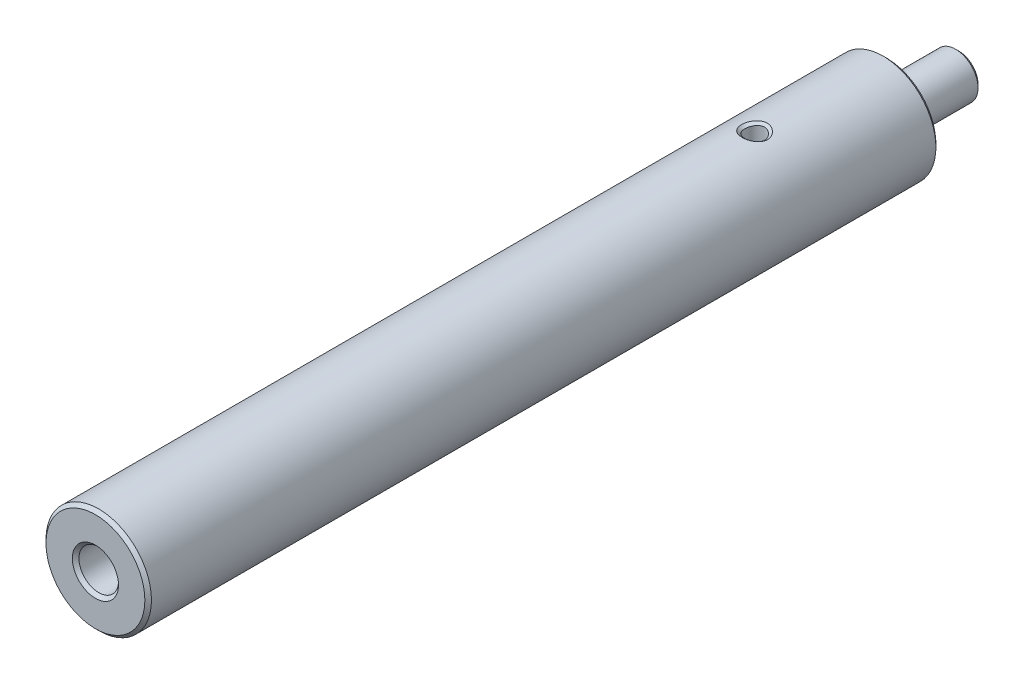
ISO-10303-21;
HEADER;
FILE_DESCRIPTION(('STEP AP214'),'2;1');
FILE_NAME('part.step','',(''),(''),'','','');
FILE_SCHEMA(('AUTOMOTIVE_DESIGN { 1 0 10303 214 1 1 1 1 }'));
ENDSEC;
DATA;
#1=APPLICATION_CONTEXT('core data for automotive mechanical design processes');
#2=APPLICATION_PROTOCOL_DEFINITION('international standard','automotive_design',2000,#1);
#3=PRODUCT_CONTEXT('',#1,'mechanical');
#4=PRODUCT('Part','Part','',(#3));
#5=PRODUCT_RELATED_PRODUCT_CATEGORY('part','',(#4));
#6=PRODUCT_DEFINITION_FORMATION('','',#4);
#7=PRODUCT_DEFINITION_CONTEXT('part definition',#1,'design');
#8=PRODUCT_DEFINITION('design','',#6,#7);
#9=PRODUCT_DEFINITION_SHAPE('','',#8);
#10=(LENGTH_UNIT() NAMED_UNIT(*) SI_UNIT(.MILLI.,.METRE.));
#11=(NAMED_UNIT(*) PLANE_ANGLE_UNIT() SI_UNIT($,.RADIAN.));
#12=(NAMED_UNIT(*) SI_UNIT($,.STERADIAN.) SOLID_ANGLE_UNIT());
#13=UNCERTAINTY_MEASURE_WITH_UNIT(LENGTH_MEASURE(1.E-05),#10,'distance_accuracy_value','');
#14=(GEOMETRIC_REPRESENTATION_CONTEXT(3) GLOBAL_UNCERTAINTY_ASSIGNED_CONTEXT((#13)) GLOBAL_UNIT_ASSIGNED_CONTEXT((#10,
#11,#12)) REPRESENTATION_CONTEXT('',''));
#15=CARTESIAN_POINT('',(0.,0.,0.));
#16=DIRECTION('',(0.,0.,1.));
#17=DIRECTION('',(1.,0.,0.));
#18=AXIS2_PLACEMENT_3D('',#15,#16,#17);
#19=CARTESIAN_POINT('',(0.,0.,0.));
#20=DIRECTION('',(0.,0.,1.));
#21=DIRECTION('',(1.,0.,0.));
#22=AXIS2_PLACEMENT_3D('',#19,#20,#21);
#23=PLANE('',#22);
#24=CARTESIAN_POINT('',(0.,0.,0.));
#25=DIRECTION('',(0.,0.,1.));
#26=DIRECTION('',(1.,0.,0.));
#27=AXIS2_PLACEMENT_3D('',#24,#25,#26);
#28=CIRCLE('',#27,1.24999999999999);
#29=CARTESIAN_POINT('',(1.24999999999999,0.,0.));
#30=VERTEX_POINT('',#29);
#31=EDGE_CURVE('E44',#30,#30,#28,.T.);
#32=ORIENTED_EDGE('',*,*,#31,.T.);
#33=EDGE_LOOP('',(#32));
#34=FACE_BOUND('',#33,.T.);
#35=ADVANCED_FACE('F29',(#34),#23,.T.);
#36=CARTESIAN_POINT('',(0.,0.,-50.5));
#37=DIRECTION('',(0.,0.,-1.));
#38=DIRECTION('',(-1.,0.,0.));
#39=AXIS2_PLACEMENT_3D('',#36,#37,#38);
#40=CYLINDRICAL_SURFACE('',#39,1.49999999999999);
#41=CARTESIAN_POINT('',(0.,0.,14.75));
#42=DIRECTION('',(0.,0.,1.));
#43=DIRECTION('',(1.,0.,0.));
#44=AXIS2_PLACEMENT_3D('',#41,#42,#43);
#45=CIRCLE('',#44,1.49999999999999);
#46=CARTESIAN_POINT('',(1.49999999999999,0.,14.75));
#47=VERTEX_POINT('',#46);
#48=EDGE_CURVE('E193',#47,#47,#45,.T.);
#49=ORIENTED_EDGE('',*,*,#48,.T.);
#50=EDGE_LOOP('',(#49));
#51=FACE_BOUND('',#50,.T.);
#52=CARTESIAN_POINT('',(0.,0.,0.25));
#53=DIRECTION('',(0.,0.,1.));
#54=DIRECTION('',(1.,0.,0.));
#55=AXIS2_PLACEMENT_3D('',#52,#53,#54);
#56=CIRCLE('',#55,1.49999999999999);
#57=CARTESIAN_POINT('',(1.49999999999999,0.,0.25));
#58=VERTEX_POINT('',#57);
#59=EDGE_CURVE('E185',#58,#58,#56,.F.);
#60=ORIENTED_EDGE('',*,*,#59,.T.);
#61=EDGE_LOOP('',(#60));
#62=FACE_BOUND('',#61,.T.);
#63=ADVANCED_FACE('F205',(#51,#62),#40,.F.);
#64=CARTESIAN_POINT('',(0.,1.49999999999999,15.));
#65=DIRECTION('',(0.,0.,1.));
#66=DIRECTION('',(1.,0.,0.));
#67=AXIS2_PLACEMENT_3D('',#64,#65,#66);
#68=PLANE('',#67);
#69=CARTESIAN_POINT('',(0.,0.,15.));
#70=DIRECTION('',(0.,0.,1.));
#71=DIRECTION('',(1.,0.,0.));
#72=AXIS2_PLACEMENT_3D('',#69,#70,#71);
#73=CIRCLE('',#72,3.75);
#74=CARTESIAN_POINT('',(3.75,0.,15.));
#75=VERTEX_POINT('',#74);
#76=EDGE_CURVE('E159',#75,#75,#73,.T.);
#77=ORIENTED_EDGE('',*,*,#76,.T.);
#78=EDGE_LOOP('',(#77));
#79=FACE_BOUND('',#78,.T.);
#80=CARTESIAN_POINT('',(0.,0.,15.));
#81=DIRECTION('',(0.,0.,1.));
#82=DIRECTION('',(1.,0.,0.));
#83=AXIS2_PLACEMENT_3D('',#80,#81,#82);
#84=CIRCLE('',#83,1.74999999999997);
#85=CARTESIAN_POINT('',(1.74999999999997,0.,15.));
#86=VERTEX_POINT('',#85);
#87=EDGE_CURVE('E156',#86,#86,#84,.F.);
#88=ORIENTED_EDGE('',*,*,#87,.T.);
#89=EDGE_LOOP('',(#88));
#90=FACE_BOUND('',#89,.T.);
#91=ADVANCED_FACE('F138',(#79,#90),#68,.T.);
#92=CARTESIAN_POINT('',(0.,0.,-50.5));
#93=DIRECTION('',(0.,0.,-1.));
#94=DIRECTION('',(-1.,0.,0.));
#95=AXIS2_PLACEMENT_3D('',#92,#93,#94);
#96=CYLINDRICAL_SURFACE('',#95,3.99999999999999);
#97=CARTESIAN_POINT('',(0.,0.,-44.75));
#98=DIRECTION('',(0.,0.,-1.));
#99=DIRECTION('',(-1.,0.,0.));
#100=AXIS2_PLACEMENT_3D('',#97,#98,#99);
#101=CIRCLE('',#100,3.99999999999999);
#102=CARTESIAN_POINT('',(-3.99999999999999,0.,-44.75));
#103=VERTEX_POINT('',#102);
#104=EDGE_CURVE('E153',#103,#103,#101,.F.);
#105=ORIENTED_EDGE('',*,*,#104,.T.);
#106=EDGE_LOOP('',(#105));
#107=FACE_BOUND('',#106,.T.);
#108=CARTESIAN_POINT('',(0.,0.,14.75));
#109=DIRECTION('',(0.,0.,1.));
#110=DIRECTION('',(1.,0.,0.));
#111=AXIS2_PLACEMENT_3D('',#108,#109,#110);
#112=CIRCLE('',#111,3.99999999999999);
#113=CARTESIAN_POINT('',(3.99999999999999,0.,14.75));
#114=VERTEX_POINT('',#113);
#115=EDGE_CURVE('E113',#114,#114,#112,.F.);
#116=ORIENTED_EDGE('',*,*,#115,.T.);
#117=EDGE_LOOP('',(#116));
#118=FACE_BOUND('',#117,.T.);
#119=CARTESIAN_POINT('',(0.,3.99999999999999,-34.0540393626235));
#120=CARTESIAN_POINT('',(0.529767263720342,4.00000418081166,-34.0540683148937));
#121=CARTESIAN_POINT('',(0.986968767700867,3.87636399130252,-34.4920224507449));
#122=CARTESIAN_POINT('',(0.986931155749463,3.87629484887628,-35.5074001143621));
#123=CARTESIAN_POINT('',(0.53069592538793,3.9999960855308,-35.9459678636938));
#124=CARTESIAN_POINT('',(-0.530811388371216,4.00000391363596,-35.9459534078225));
#125=CARTESIAN_POINT('',(-0.986852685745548,3.87629943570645,-35.5070128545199));
#126=CARTESIAN_POINT('',(-0.987046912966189,3.87635948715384,-34.4917578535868));
#127=CARTESIAN_POINT('',(-0.529767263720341,3.99999581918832,-34.0540104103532));
#128=CARTESIAN_POINT('',(0.,3.99999999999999,-34.0540393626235));
#129=B_SPLINE_CURVE_WITH_KNOTS('',3,(#119,#120,#121,#122,#123,#124,#125,#126,#127,#128),
.UNSPECIFIED.,.T.,.F.,(4,2,2,2,4),(-0.00592829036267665,-0.00444372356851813,
-0.00295915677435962,-0.00147458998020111,9.97681395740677E-06),.UNSPECIFIED.);
#130=CARTESIAN_POINT('',(0.,3.99999999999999,-34.0540393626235));
#131=VERTEX_POINT('',#130);
#132=EDGE_CURVE('E110',#131,#131,#129,.F.);
#133=ORIENTED_EDGE('',*,*,#132,.T.);
#134=EDGE_LOOP('',(#133));
#135=FACE_BOUND('',#134,.T.);
#136=CARTESIAN_POINT('',(0.,-3.99999999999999,-34.0540393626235));
#137=CARTESIAN_POINT('',(-0.529767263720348,-4.00000418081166,-34.0540683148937));
#138=CARTESIAN_POINT('',(-0.986968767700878,-3.87636399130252,-34.4920224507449));
#139=CARTESIAN_POINT('',(-0.986931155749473,-3.87629484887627,-35.5074001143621));
#140=CARTESIAN_POINT('',(-0.530695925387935,-3.9999960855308,-35.9459678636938));
#141=CARTESIAN_POINT('',(0.530811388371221,-4.00000391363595,-35.9459534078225));
#142=CARTESIAN_POINT('',(0.986852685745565,-3.87629943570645,-35.5070128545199));
#143=CARTESIAN_POINT('',(0.987046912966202,-3.87635948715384,-34.4917578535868));
#144=CARTESIAN_POINT('',(0.529767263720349,-3.99999581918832,-34.0540104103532));
#145=CARTESIAN_POINT('',(0.,-3.99999999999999,-34.0540393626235));
#146=B_SPLINE_CURVE_WITH_KNOTS('',3,(#136,#137,#138,#139,#140,#141,#142,#143,#144,#145),
.UNSPECIFIED.,.T.,.F.,(4,2,2,2,4),(-0.00592829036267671,-0.00444372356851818,
-0.00295915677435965,-0.00147458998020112,9.9768139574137E-06),.UNSPECIFIED.);
#147=CARTESIAN_POINT('',(0.,-3.99999999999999,-34.0540393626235));
#148=VERTEX_POINT('',#147);
#149=EDGE_CURVE('E107',#148,#148,#146,.F.);
#150=ORIENTED_EDGE('',*,*,#149,.T.);
#151=EDGE_LOOP('',(#150));
#152=FACE_BOUND('',#151,.T.);
#153=ADVANCED_FACE('F127',(#107,#118,#135,#152),#96,.T.);
#154=CARTESIAN_POINT('',(0.,3.99999999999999,-45.));
#155=DIRECTION('',(0.,0.,-1.));
#156=DIRECTION('',(-1.,0.,0.));
#157=AXIS2_PLACEMENT_3D('',#154,#155,#156);
#158=PLANE('',#157);
#159=CARTESIAN_POINT('',(0.,0.,-45.));
#160=DIRECTION('',(0.,0.,-1.));
#161=DIRECTION('',(-1.,0.,0.));
#162=AXIS2_PLACEMENT_3D('',#159,#160,#161);
#163=CIRCLE('',#162,3.75);
#164=CARTESIAN_POINT('',(-3.75,0.,-45.));
#165=VERTEX_POINT('',#164);
#166=EDGE_CURVE('E111',#165,#165,#163,.T.);
#167=ORIENTED_EDGE('',*,*,#166,.T.);
#168=EDGE_LOOP('',(#167));
#169=FACE_BOUND('',#168,.T.);
#170=CARTESIAN_POINT('',(0.,0.,-45.));
#171=DIRECTION('',(0.,0.,-1.));
#172=DIRECTION('',(-1.,0.,0.));
#173=AXIS2_PLACEMENT_3D('',#170,#171,#172);
#174=CIRCLE('',#173,1.7);
#175=CARTESIAN_POINT('',(-1.7,0.,-45.));
#176=VERTEX_POINT('',#175);
#177=EDGE_CURVE('E115',#176,#176,#174,.T.);
#178=ORIENTED_EDGE('',*,*,#177,.F.);
#179=EDGE_LOOP('',(#178));
#180=FACE_BOUND('',#179,.T.);
#181=ADVANCED_FACE('F137',(#169,#180),#158,.T.);
#182=CARTESIAN_POINT('',(0.,0.,-50.5));
#183=DIRECTION('',(0.,0.,-1.));
#184=DIRECTION('',(-1.,0.,0.));
#185=AXIS2_PLACEMENT_3D('',#182,#183,#184);
#186=CYLINDRICAL_SURFACE('',#185,1.7);
#187=CARTESIAN_POINT('',(0.,0.,-50.25));
#188=DIRECTION('',(0.,0.,-1.));
#189=DIRECTION('',(-1.,0.,0.));
#190=AXIS2_PLACEMENT_3D('',#187,#188,#189);
#191=CIRCLE('',#190,1.7);
#192=CARTESIAN_POINT('',(-1.7,0.,-50.25));
#193=VERTEX_POINT('',#192);
#194=EDGE_CURVE('E10',#193,#193,#191,.F.);
#195=ORIENTED_EDGE('',*,*,#194,.T.);
#196=EDGE_LOOP('',(#195));
#197=FACE_BOUND('',#196,.T.);
#198=ORIENTED_EDGE('',*,*,#177,.T.);
#199=EDGE_LOOP('',(#198));
#200=FACE_BOUND('',#199,.T.);
#201=ADVANCED_FACE('F267',(#197,#200),#186,.T.);
#202=CARTESIAN_POINT('',(0.,1.7,-50.5));
#203=DIRECTION('',(0.,0.,-1.));
#204=DIRECTION('',(-1.,0.,0.));
#205=AXIS2_PLACEMENT_3D('',#202,#203,#204);
#206=PLANE('',#205);
#207=CARTESIAN_POINT('',(0.,0.,-50.5));
#208=DIRECTION('',(0.,0.,-1.));
#209=DIRECTION('',(-1.,0.,0.));
#210=AXIS2_PLACEMENT_3D('',#207,#208,#209);
#211=CIRCLE('',#210,1.45000000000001);
#212=CARTESIAN_POINT('',(-1.45000000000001,0.,-50.5));
#213=VERTEX_POINT('',#212);
#214=EDGE_CURVE('E39',#213,#213,#211,.T.);
#215=ORIENTED_EDGE('',*,*,#214,.T.);
#216=EDGE_LOOP('',(#215));
#217=FACE_BOUND('',#216,.T.);
#218=ADVANCED_FACE('F179',(#217),#206,.T.);
#219=CARTESIAN_POINT('',(0.,-5.,-35.));
#220=DIRECTION('',(0.,1.,0.));
#221=DIRECTION('',(0.,0.,1.));
#222=AXIS2_PLACEMENT_3D('',#219,#220,#221);
#223=CYLINDRICAL_SURFACE('',#222,0.750000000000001);
#224=CARTESIAN_POINT('',(0.,3.83387458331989,-34.25));
#225=CARTESIAN_POINT('',(-0.0125312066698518,3.83387479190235,-34.2499984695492));
#226=CARTESIAN_POINT('',(-0.0250619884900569,3.83375953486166,-34.2503348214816));
#227=CARTESIAN_POINT('',(-0.0499976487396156,3.8333105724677,-34.251672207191));
#228=CARTESIAN_POINT('',(-0.0624028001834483,3.83297837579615,-34.2526686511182));
#229=CARTESIAN_POINT('',(-0.087068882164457,3.83211006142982,-34.2553081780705));
#230=CARTESIAN_POINT('',(-0.0993302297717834,3.83157505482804,-34.2569477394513));
#231=CARTESIAN_POINT('',(-0.123690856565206,3.83031606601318,-34.260854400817));
#232=CARTESIAN_POINT('',(-0.135790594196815,3.82959286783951,-34.2631188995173));
#233=CARTESIAN_POINT('',(-0.159810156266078,3.82797223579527,-34.2682568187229));
#234=CARTESIAN_POINT('',(-0.171730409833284,3.8270753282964,-34.2711284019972));
#235=CARTESIAN_POINT('',(-0.195373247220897,3.82512198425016,-34.2774619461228));
#236=CARTESIAN_POINT('',(-0.207096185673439,3.82406587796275,-34.2809226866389));
#237=CARTESIAN_POINT('',(-0.230326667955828,3.82180877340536,-34.2884161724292));
#238=CARTESIAN_POINT('',(-0.241834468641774,3.82060796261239,-34.2924481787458));
#239=CARTESIAN_POINT('',(-0.264616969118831,3.81807603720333,-34.3010659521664));
#240=CARTESIAN_POINT('',(-0.275891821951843,3.81674501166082,-34.3056513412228));
#241=CARTESIAN_POINT('',(-0.29819072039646,3.81396720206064,-34.3153577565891));
#242=CARTESIAN_POINT('',(-0.309214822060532,3.81252044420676,-34.3204786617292));
#243=CARTESIAN_POINT('',(-0.330994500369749,3.80952568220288,-34.3312380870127));
#244=CARTESIAN_POINT('',(-0.341750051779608,3.80797766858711,-34.336876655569));
#245=CARTESIAN_POINT('',(-0.362974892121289,3.80479488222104,-34.3486534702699));
#246=CARTESIAN_POINT('',(-0.37344409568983,3.80316008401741,-34.3547918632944));
#247=CARTESIAN_POINT('',(-0.394078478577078,3.79981819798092,-34.3675504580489));
#248=CARTESIAN_POINT('',(-0.404243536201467,3.79811108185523,-34.3741708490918));
#249=CARTESIAN_POINT('',(-0.424251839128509,3.79463901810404,-34.3878756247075));
#250=CARTESIAN_POINT('',(-0.434094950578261,3.79287404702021,-34.3949601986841));
#251=CARTESIAN_POINT('',(-0.453441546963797,3.78930072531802,-34.4095755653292));
#252=CARTESIAN_POINT('',(-0.462944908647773,3.78749235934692,-34.41710651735));
#253=CARTESIAN_POINT('',(-0.481594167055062,3.78384669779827,-34.4325968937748));
#254=CARTESIAN_POINT('',(-0.490739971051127,3.7820093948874,-34.4405564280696));
#255=CARTESIAN_POINT('',(-0.508656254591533,3.77832031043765,-34.4568862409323));
#256=CARTESIAN_POINT('',(-0.517426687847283,3.77646852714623,-34.4652565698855));
#257=CARTESIAN_POINT('',(-0.534574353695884,3.77276493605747,-34.4823902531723));
#258=CARTESIAN_POINT('',(-0.542951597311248,3.77091312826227,-34.4911535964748));
#259=CARTESIAN_POINT('',(-0.559294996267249,3.7672239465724,-34.5090555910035));
#260=CARTESIAN_POINT('',(-0.567261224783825,3.76538657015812,-34.518194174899));
#261=CARTESIAN_POINT('',(-0.582764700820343,3.76174071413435,-34.536828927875));
#262=CARTESIAN_POINT('',(-0.590302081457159,3.7599322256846,-34.5463249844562));
#263=CARTESIAN_POINT('',(-0.604929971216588,3.75635861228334,-34.5656569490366));
#264=CARTESIAN_POINT('',(-0.612020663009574,3.75459346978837,-34.5754927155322));
#265=CARTESIAN_POINT('',(-0.625737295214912,3.75112101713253,-34.5954863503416));
#266=CARTESIAN_POINT('',(-0.632363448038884,3.7494136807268,-34.6056440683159));
#267=CARTESIAN_POINT('',(-0.645133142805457,3.74607130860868,-34.6262638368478));
#268=CARTESIAN_POINT('',(-0.651276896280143,3.74443624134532,-34.6367257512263));
#269=CARTESIAN_POINT('',(-0.663063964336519,3.74125287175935,-34.6579361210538));
#270=CARTESIAN_POINT('',(-0.668707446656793,3.73970454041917,-34.6686844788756));
#271=CARTESIAN_POINT('',(-0.679476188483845,3.73670909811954,-34.6904499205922));
#272=CARTESIAN_POINT('',(-0.684601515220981,3.73526197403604,-34.7014669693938));
#273=CARTESIAN_POINT('',(-0.694316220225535,3.73248338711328,-34.7237519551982));
#274=CARTESIAN_POINT('',(-0.698905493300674,3.73115194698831,-34.7350199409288));
#275=CARTESIAN_POINT('',(-0.707530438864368,3.72861914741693,-34.7577889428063));
#276=CARTESIAN_POINT('',(-0.711565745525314,3.72741787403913,-34.7692901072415));
#277=CARTESIAN_POINT('',(-0.719065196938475,3.72515979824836,-34.7925075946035));
#278=CARTESIAN_POINT('',(-0.722528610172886,3.7241031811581,-34.8042241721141));
#279=CARTESIAN_POINT('',(-0.728866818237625,3.72214877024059,-34.8278546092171));
#280=CARTESIAN_POINT('',(-0.731740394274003,3.72125130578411,-34.8397688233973));
#281=CARTESIAN_POINT('',(-0.736881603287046,3.71962950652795,-34.8637766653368));
#282=CARTESIAN_POINT('',(-0.739147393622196,3.7189056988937,-34.8758707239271));
#283=CARTESIAN_POINT('',(-0.743055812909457,3.71764546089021,-34.9002204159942));
#284=CARTESIAN_POINT('',(-0.744695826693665,3.71710981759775,-34.9124765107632));
#285=CARTESIAN_POINT('',(-0.747335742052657,3.71624010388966,-34.9371324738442));
#286=CARTESIAN_POINT('',(-0.748332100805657,3.71590714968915,-34.9495327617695));
#287=CARTESIAN_POINT('',(-0.749667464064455,3.71545689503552,-34.9744594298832));
#288=CARTESIAN_POINT('',(-0.750001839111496,3.71534111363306,-34.9869860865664));
#289=CARTESIAN_POINT('',(-0.749997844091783,3.71533938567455,-35.0120402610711));
#290=CARTESIAN_POINT('',(-0.749659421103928,3.71545345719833,-35.0245677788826));
#291=CARTESIAN_POINT('',(-0.748318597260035,3.71590054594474,-35.0494979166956));
#292=CARTESIAN_POINT('',(-0.74732071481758,3.71623207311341,-35.0619008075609));
#293=CARTESIAN_POINT('',(-0.744679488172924,3.71709910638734,-35.0865636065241));
#294=CARTESIAN_POINT('',(-0.743039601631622,3.71763351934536,-35.0988239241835));
#295=CARTESIAN_POINT('',(-0.739133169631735,3.7188914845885,-35.1231835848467));
#296=CARTESIAN_POINT('',(-0.736869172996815,3.71961426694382,-35.1352833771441));
#297=CARTESIAN_POINT('',(-0.731733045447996,3.72123419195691,-35.1593040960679));
#298=CARTESIAN_POINT('',(-0.728862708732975,3.72213081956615,-35.171225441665));
#299=CARTESIAN_POINT('',(-0.722532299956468,3.72408372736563,-35.1948714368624));
#300=CARTESIAN_POINT('',(-0.719073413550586,3.72513968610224,-35.2065964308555));
#301=CARTESIAN_POINT('',(-0.7115841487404,3.72739660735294,-35.2298319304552));
#302=CARTESIAN_POINT('',(-0.707554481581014,3.72859738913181,-35.2413426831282));
#303=CARTESIAN_POINT('',(-0.698941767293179,3.73112935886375,-35.2641319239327));
#304=CARTESIAN_POINT('',(-0.69435907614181,3.73246046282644,-35.2754105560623));
#305=CARTESIAN_POINT('',(-0.684658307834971,3.73523852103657,-35.2977177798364));
#306=CARTESIAN_POINT('',(-0.679540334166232,3.73668545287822,-35.3087464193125));
#307=CARTESIAN_POINT('',(-0.668786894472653,3.73968064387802,-35.3305358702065));
#308=CARTESIAN_POINT('',(-0.663151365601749,3.74122891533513,-35.3412966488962));
#309=CARTESIAN_POINT('',(-0.651380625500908,3.74441228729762,-35.362532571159));
#310=CARTESIAN_POINT('',(-0.645245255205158,3.74604741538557,-35.3730076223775));
#311=CARTESIAN_POINT('',(-0.632492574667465,3.7493900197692,-35.393654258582));
#312=CARTESIAN_POINT('',(-0.625875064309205,3.75109752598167,-35.4038257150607));
#313=CARTESIAN_POINT('',(-0.612175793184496,3.75457041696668,-35.4238473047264));
#314=CARTESIAN_POINT('',(-0.605093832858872,3.75633582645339,-35.4336972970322));
#315=CARTESIAN_POINT('',(-0.590483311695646,3.75991006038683,-35.4530580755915));
#316=CARTESIAN_POINT('',(-0.582954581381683,3.76171890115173,-35.4625687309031));
#317=CARTESIAN_POINT('',(-0.567468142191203,3.76536553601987,-35.4812329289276));
#318=CARTESIAN_POINT('',(-0.559510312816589,3.7672033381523,-35.490386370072));
#319=CARTESIAN_POINT('',(-0.543183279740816,3.77089343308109,-35.5083182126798));
#320=CARTESIAN_POINT('',(-0.534814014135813,3.77274572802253,-35.5170965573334));
#321=CARTESIAN_POINT('',(-0.517681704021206,3.77645034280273,-35.5342602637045));
#322=CARTESIAN_POINT('',(-0.508918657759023,3.77830266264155,-35.5426456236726));
#323=CARTESIAN_POINT('',(-0.491016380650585,3.78199285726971,-35.5590054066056));
#324=CARTESIAN_POINT('',(-0.481877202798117,3.78383073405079,-35.5669798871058));
#325=CARTESIAN_POINT('',(-0.46324026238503,3.7874775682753,-35.5824999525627));
#326=CARTESIAN_POINT('',(-0.453742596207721,3.78928653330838,-35.5900456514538));
#327=CARTESIAN_POINT('',(-0.434406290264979,3.79286106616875,-35.604690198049));
#328=CARTESIAN_POINT('',(-0.424567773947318,3.79462664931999,-35.6117892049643));
#329=CARTESIAN_POINT('',(-0.404567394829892,3.79809993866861,-35.6255224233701));
#330=CARTESIAN_POINT('',(-0.394405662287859,3.79980766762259,-35.632156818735));
#331=CARTESIAN_POINT('',(-0.373776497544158,3.80315076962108,-35.6449428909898));
#332=CARTESIAN_POINT('',(-0.363309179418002,3.80478616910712,-35.6510947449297));
#333=CARTESIAN_POINT('',(-0.342086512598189,3.807970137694,-35.6628978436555));
#334=CARTESIAN_POINT('',(-0.331331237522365,3.80951872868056,-35.6685492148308));
#335=CARTESIAN_POINT('',(-0.309550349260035,3.81251461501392,-35.6793335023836));
#336=CARTESIAN_POINT('',(-0.298524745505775,3.8139619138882,-35.6844664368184));
#337=CARTESIAN_POINT('',(-0.276220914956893,3.81674076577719,-35.6941960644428));
#338=CARTESIAN_POINT('',(-0.264942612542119,3.81807228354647,-35.6987925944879));
#339=CARTESIAN_POINT('',(-0.242151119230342,3.82060514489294,-35.7074317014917));
#340=CARTESIAN_POINT('',(-0.230637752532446,3.8218063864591,-35.7114738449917));
#341=CARTESIAN_POINT('',(-0.207393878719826,3.82406429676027,-35.7189865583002));
#342=CARTESIAN_POINT('',(-0.195663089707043,3.82512076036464,-35.7224563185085));
#343=CARTESIAN_POINT('',(-0.172002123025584,3.82707475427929,-35.7288067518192));
#344=CARTESIAN_POINT('',(-0.160071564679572,3.82797193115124,-35.7316861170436));
#345=CARTESIAN_POINT('',(-0.136028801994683,3.82959303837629,-35.736838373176));
#346=CARTESIAN_POINT('',(-0.12391614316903,3.83031641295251,-35.7391093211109));
#347=CARTESIAN_POINT('',(-0.0995268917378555,3.8315756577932,-35.7430274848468));
#348=CARTESIAN_POINT('',(-0.087249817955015,3.83211070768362,-35.7446719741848));
#349=CARTESIAN_POINT('',(-0.0625494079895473,3.83297911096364,-35.7473201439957));
#350=CARTESIAN_POINT('',(-0.0501256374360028,3.83331131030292,-35.7483201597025));
#351=CARTESIAN_POINT('',(-0.0251493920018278,3.83375988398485,-35.7496623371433));
#352=CARTESIAN_POINT('',(-0.0125966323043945,3.83387469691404,-35.7499997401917));
#353=CARTESIAN_POINT('',(0.0125090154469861,3.83387446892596,-35.7500002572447));
#354=CARTESIAN_POINT('',(0.0250619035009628,3.83375942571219,-35.7496633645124));
#355=CARTESIAN_POINT('',(0.0500386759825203,3.83331042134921,-35.7483228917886));
#356=CARTESIAN_POINT('',(0.0624628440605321,3.83297801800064,-35.7473240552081));
#357=CARTESIAN_POINT('',(0.0871642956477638,3.83210922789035,-35.7446786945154));
#358=CARTESIAN_POINT('',(0.0994420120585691,3.83157399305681,-35.7430358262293));
#359=CARTESIAN_POINT('',(0.123832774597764,3.83031439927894,-35.7391213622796));
#360=CARTESIAN_POINT('',(0.135946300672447,3.82959085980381,-35.7368524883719));
#361=CARTESIAN_POINT('',(0.159991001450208,3.82796944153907,-35.7317047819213));
#362=CARTESIAN_POINT('',(0.171922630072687,3.82707211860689,-35.7288278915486));
#363=CARTESIAN_POINT('',(0.195585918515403,3.82511784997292,-35.7224827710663));
#364=CARTESIAN_POINT('',(0.207317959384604,3.82406125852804,-35.7190158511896));
#365=CARTESIAN_POINT('',(0.230564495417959,3.82180310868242,-35.7115091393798));
#366=CARTESIAN_POINT('',(0.242079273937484,3.82060175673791,-35.7074701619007));
#367=CARTESIAN_POINT('',(0.26487372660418,3.81806868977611,-35.6988376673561));
#368=CARTESIAN_POINT('',(0.276153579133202,3.81673707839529,-35.6942445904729));
#369=CARTESIAN_POINT('',(0.298460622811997,3.81395805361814,-35.6845221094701));
#370=CARTESIAN_POINT('',(0.309487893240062,3.81251067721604,-35.6793928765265));
#371=CARTESIAN_POINT('',(0.331272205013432,3.80951464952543,-35.6686161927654));
#372=CARTESIAN_POINT('',(0.342029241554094,3.80796599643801,-35.6629687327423));
#373=CARTESIAN_POINT('',(0.363255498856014,3.80478191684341,-35.6511736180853));
#374=CARTESIAN_POINT('',(0.373724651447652,3.80314647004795,-35.6450258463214));
#375=CARTESIAN_POINT('',(0.394357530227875,3.79980328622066,-35.6322480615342));
#376=CARTESIAN_POINT('',(0.4045211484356,3.79809552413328,-35.6256178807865));
#377=CARTESIAN_POINT('',(0.424525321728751,3.79462218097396,-35.611893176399));
#378=CARTESIAN_POINT('',(0.434365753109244,3.79285657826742,-35.6047984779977));
#379=CARTESIAN_POINT('',(0.453705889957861,3.78928201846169,-35.5901625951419));
#380=CARTESIAN_POINT('',(0.463205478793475,3.78747304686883,-35.5826212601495));
#381=CARTESIAN_POINT('',(0.481846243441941,3.78382621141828,-35.567109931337));
#382=CARTESIAN_POINT('',(0.490987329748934,3.78198834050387,-35.5591398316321));
#383=CARTESIAN_POINT('',(0.508893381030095,3.77829816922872,-35.5427887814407));
#384=CARTESIAN_POINT('',(0.517658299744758,3.7764458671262,-35.5344077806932));
#385=CARTESIAN_POINT('',(0.534794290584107,3.77274129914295,-35.5172527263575));
#386=CARTESIAN_POINT('',(0.543165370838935,3.77088903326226,-35.5084786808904));
#387=CARTESIAN_POINT('',(0.559495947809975,3.76719900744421,-35.49055533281));
#388=CARTESIAN_POINT('',(0.567455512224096,3.76536124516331,-35.4814060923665));
#389=CARTESIAN_POINT('',(0.582945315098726,3.7617147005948,-35.4627501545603));
#390=CARTESIAN_POINT('',(0.590475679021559,3.75990590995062,-35.4532435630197));
#391=CARTESIAN_POINT('',(0.605089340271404,3.7563317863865,-35.4338907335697));
#392=CARTESIAN_POINT('',(0.61217281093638,3.75456643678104,-35.4240446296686));
#393=CARTESIAN_POINT('',(0.625874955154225,3.75109367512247,-35.4040306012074));
#394=CARTESIAN_POINT('',(0.632493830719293,3.74938623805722,-35.3938628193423));
#395=CARTESIAN_POINT('',(0.645249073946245,3.74604378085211,-35.3732232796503));
#396=CARTESIAN_POINT('',(0.651385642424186,3.74440873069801,-35.3627516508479));
#397=CARTESIAN_POINT('',(0.663158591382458,3.74122552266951,-35.341522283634));
#398=CARTESIAN_POINT('',(0.668795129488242,3.73967733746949,-35.3307646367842));
#399=CARTESIAN_POINT('',(0.679550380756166,3.73668232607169,-35.308981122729));
#400=CARTESIAN_POINT('',(0.684669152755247,3.73523548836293,-35.2979552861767));
#401=CARTESIAN_POINT('',(0.694371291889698,3.73245762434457,-35.2756533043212));
#402=CARTESIAN_POINT('',(0.698954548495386,3.73112662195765,-35.2643771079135));
#403=CARTESIAN_POINT('',(0.707568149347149,3.72859485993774,-35.2415923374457));
#404=CARTESIAN_POINT('',(0.711598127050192,3.72739418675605,-35.2300836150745));
#405=CARTESIAN_POINT('',(0.719087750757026,3.7251374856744,-35.2068517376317));
#406=CARTESIAN_POINT('',(0.722546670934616,3.72408164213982,-35.1951283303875));
#407=CARTESIAN_POINT('',(0.728876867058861,3.72212896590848,-35.1714850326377));
#408=CARTESIAN_POINT('',(0.73174693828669,3.72123245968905,-35.1595647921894));
#409=CARTESIAN_POINT('',(0.736882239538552,3.71961277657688,-35.1355457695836));
#410=CARTESIAN_POINT('',(0.739145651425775,3.71889012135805,-35.1234465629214));
#411=CARTESIAN_POINT('',(0.743050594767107,3.71763240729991,-35.0990875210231));
#412=CARTESIAN_POINT('',(0.744689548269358,3.71709812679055,-35.0868272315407));
#413=CARTESIAN_POINT('',(0.747328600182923,3.71623135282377,-35.0621638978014));
#414=CARTESIAN_POINT('',(0.748325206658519,3.71589996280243,-35.049760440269));
#415=CARTESIAN_POINT('',(0.749663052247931,3.71545314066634,-35.0248285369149));
#416=CARTESIAN_POINT('',(0.74999973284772,3.71533921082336,-35.0122998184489));
#417=CARTESIAN_POINT('',(0.750000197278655,3.71534120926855,-34.9872428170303));
#418=CARTESIAN_POINT('',(0.749664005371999,3.71545712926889,-34.9747145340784));
#419=CARTESIAN_POINT('',(0.748325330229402,3.71590765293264,-34.94978440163));
#420=CARTESIAN_POINT('',(0.747327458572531,3.71624074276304,-34.9373822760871));
#421=CARTESIAN_POINT('',(0.744684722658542,3.71711072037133,-34.9127224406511));
#422=CARTESIAN_POINT('',(0.743043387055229,3.71764649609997,-34.9004643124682));
#423=CARTESIAN_POINT('',(0.73913254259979,3.71890699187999,-34.8761103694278));
#424=CARTESIAN_POINT('',(0.7368656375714,3.71963092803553,-34.8640140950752));
#425=CARTESIAN_POINT('',(0.731722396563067,3.72125297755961,-34.8400016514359));
#426=CARTESIAN_POINT('',(0.728847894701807,3.72215056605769,-34.8280850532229));
#427=CARTESIAN_POINT('',(0.722508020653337,3.72410521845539,-34.8044496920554));
#428=CARTESIAN_POINT('',(0.719043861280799,3.72516195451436,-34.7927305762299));
#429=CARTESIAN_POINT('',(0.711543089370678,3.72742026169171,-34.7695078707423));
#430=CARTESIAN_POINT('',(0.707507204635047,3.7286216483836,-34.7580040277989));
#431=CARTESIAN_POINT('',(0.698881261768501,3.7311546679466,-34.7352295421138));
#432=CARTESIAN_POINT('',(0.694291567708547,3.73248621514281,-34.7239587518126));
#433=CARTESIAN_POINT('',(0.684576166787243,3.73526500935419,-34.7016680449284));
#434=CARTESIAN_POINT('',(0.679450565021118,3.73671223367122,-34.6906480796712));
#435=CARTESIAN_POINT('',(0.668681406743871,3.73970786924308,-34.6688767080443));
#436=CARTESIAN_POINT('',(0.663037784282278,3.74125629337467,-34.6581253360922));
#437=CARTESIAN_POINT('',(0.651250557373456,3.74443984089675,-34.6369088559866));
#438=CARTESIAN_POINT('',(0.645106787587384,3.74607499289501,-34.6264438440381));
#439=CARTESIAN_POINT('',(0.632337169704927,3.74941752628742,-34.6058178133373));
#440=CARTESIAN_POINT('',(0.625711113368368,3.75112493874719,-34.5956569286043));
#441=CARTESIAN_POINT('',(0.611994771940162,3.75459753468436,-34.57565690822));
#442=CARTESIAN_POINT('',(0.604904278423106,3.75636274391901,-34.5658179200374));
#443=CARTESIAN_POINT('',(0.590276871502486,3.75993648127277,-34.5464794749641));
#444=CARTESIAN_POINT('',(0.582739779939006,3.76174502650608,-34.5369801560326));
#445=CARTESIAN_POINT('',(0.567236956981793,3.76539098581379,-34.5183388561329));
#446=CARTESIAN_POINT('',(0.559271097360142,3.76722840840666,-34.5091969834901));
#447=CARTESIAN_POINT('',(0.542928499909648,3.77091767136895,-34.4912884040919));
#448=CARTESIAN_POINT('',(0.534551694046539,3.77276951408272,-34.4825217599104));
#449=CARTESIAN_POINT('',(0.517404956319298,3.7764731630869,-34.4653814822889));
#450=CARTESIAN_POINT('',(0.508635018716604,3.77832496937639,-34.4570078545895));
#451=CARTESIAN_POINT('',(0.490719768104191,3.78201408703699,-34.4406714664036));
#452=CARTESIAN_POINT('',(0.481574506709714,3.78385140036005,-34.4327086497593));
#453=CARTESIAN_POINT('',(0.462926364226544,3.78749706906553,-34.417211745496));
#454=CARTESIAN_POINT('',(0.453423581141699,3.78930543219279,-34.4096775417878));
#455=CARTESIAN_POINT('',(0.434078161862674,3.79287873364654,-34.3950557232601));
#456=CARTESIAN_POINT('',(0.424235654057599,3.79464368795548,-34.3879679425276));
#457=CARTESIAN_POINT('',(0.404228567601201,3.79811570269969,-34.374256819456));
#458=CARTESIAN_POINT('',(0.394064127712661,3.79982278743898,-34.3676332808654));
#459=CARTESIAN_POINT('',(0.373430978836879,3.80316459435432,-34.3548684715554));
#460=CARTESIAN_POINT('',(0.362962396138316,3.80479934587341,-34.3487270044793));
#461=CARTESIAN_POINT('',(0.341738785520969,3.80798202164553,-34.3369441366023));
#462=CARTESIAN_POINT('',(0.330983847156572,3.80952997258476,-34.3313025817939));
#463=CARTESIAN_POINT('',(0.309205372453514,3.81252459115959,-34.3205372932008));
#464=CARTESIAN_POINT('',(0.298181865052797,3.81397126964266,-34.3154135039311));
#465=CARTESIAN_POINT('',(0.275884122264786,3.81674890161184,-34.305701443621));
#466=CARTESIAN_POINT('',(0.264609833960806,3.81807983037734,-34.301113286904));
#467=CARTESIAN_POINT('',(0.241828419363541,3.8206115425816,-34.2924901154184));
#468=CARTESIAN_POINT('',(0.230321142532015,3.82181223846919,-34.2884554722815));
#469=CARTESIAN_POINT('',(0.207091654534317,3.82406909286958,-34.2809568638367));
#470=CARTESIAN_POINT('',(0.195369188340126,3.82512506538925,-34.2774936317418));
#471=CARTESIAN_POINT('',(0.171727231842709,3.82707812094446,-34.2711552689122));
#472=CARTESIAN_POINT('',(0.159807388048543,3.82797487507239,-34.2682813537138));
#473=CARTESIAN_POINT('',(0.135788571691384,3.82959517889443,-34.263138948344));
#474=CARTESIAN_POINT('',(0.123689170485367,3.83031820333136,-34.2608722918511));
#475=CARTESIAN_POINT('',(0.0993291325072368,3.83157682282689,-34.2569615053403));
#476=CARTESIAN_POINT('',(0.0870680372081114,3.83211163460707,-34.2553199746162));
#477=CARTESIAN_POINT('',(0.0624023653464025,3.83297953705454,-34.2526767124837));
#478=CARTESIAN_POINT('',(0.0499973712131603,3.83331151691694,-34.2516785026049));
#479=CARTESIAN_POINT('',(0.0250619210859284,3.83376002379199,-34.250337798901));
#480=CARTESIAN_POINT('',(0.0125311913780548,3.83387504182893,-34.2499998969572));
#481=CARTESIAN_POINT('',(0.,3.83387458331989,-34.25));
#482=B_SPLINE_CURVE_WITH_KNOTS('',3,(#224,#225,#226,#227,#228,#229,#230,#231,#232,#233,#234,
#235,#236,#237,#238,#239,#240,#241,#242,#243,#244,#245,#246,#247,#248,#249,#250,#251,#252,#253,
#254,#255,#256,#257,#258,#259,#260,#261,#262,#263,#264,#265,#266,#267,#268,#269,#270,#271,#272,
#273,#274,#275,#276,#277,#278,#279,#280,#281,#282,#283,#284,#285,#286,#287,#288,#289,#290,#291,
#292,#293,#294,#295,#296,#297,#298,#299,#300,#301,#302,#303,#304,#305,#306,#307,#308,#309,#310,
#311,#312,#313,#314,#315,#316,#317,#318,#319,#320,#321,#322,#323,#324,#325,#326,#327,#328,#329,
#330,#331,#332,#333,#334,#335,#336,#337,#338,#339,#340,#341,#342,#343,#344,#345,#346,#347,#348,
#349,#350,#351,#352,#353,#354,#355,#356,#357,#358,#359,#360,#361,#362,#363,#364,#365,#366,#367,
#368,#369,#370,#371,#372,#373,#374,#375,#376,#377,#378,#379,#380,#381,#382,#383,#384,#385,#386,
#387,#388,#389,#390,#391,#392,#393,#394,#395,#396,#397,#398,#399,#400,#401,#402,#403,#404,#405,
#406,#407,#408,#409,#410,#411,#412,#413,#414,#415,#416,#417,#418,#419,#420,#421,#422,#423,#424,
#425,#426,#427,#428,#429,#430,#431,#432,#433,#434,#435,#436,#437,#438,#439,#440,#441,#442,#443,
#444,#445,#446,#447,#448,#449,#450,#451,#452,#453,#454,#455,#456,#457,#458,#459,#460,#461,#462,
#463,#464,#465,#466,#467,#468,#469,#470,#471,#472,#473,#474,#475,#476,#477,#478,#479,#480,#481),
.UNSPECIFIED.,.F.,.F.,(4,2,2,2,2,2,2,2,2,2,2,2,2,2,2,2,2,2,2,2,2,2,2,2,2,2,2,2,2,2,2,2,2,2,2,2,
2,2,2,2,2,2,2,2,2,2,2,2,2,2,2,2,2,2,2,2,2,2,2,2,2,2,2,2,2,2,2,2,2,2,2,2,2,2,2,2,2,2,2,2,2,2,2,2,
2,2,2,2,2,2,2,2,2,2,2,2,2,2,2,2,2,2,2,2,2,2,2,2,2,2,2,2,2,2,2,2,2,2,2,2,2,2,2,2,2,2,2,2,4),(0.,
0.0375878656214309,0.0749170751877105,0.112044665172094,0.149019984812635,0.18588496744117,
0.222674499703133,0.259416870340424,0.296134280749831,0.33284340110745,0.369555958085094,
0.406279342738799,0.443017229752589,0.479770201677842,0.516536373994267,0.553312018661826,
0.590092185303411,0.626871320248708,0.663643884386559,0.700404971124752,0.737150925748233,
0.773879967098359,0.810592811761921,0.847293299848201,0.883989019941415,0.920691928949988,
0.957418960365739,0.994192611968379,1.03104150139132,1.06800087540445,1.10511305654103,
1.14242780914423,1.18000260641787,1.2175803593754,1.25490327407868,1.29202788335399,
1.32900306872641,1.36587033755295,1.40266419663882,1.43941260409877,1.47613748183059,
1.51285527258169,1.5495775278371,1.58631151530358,1.62306083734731,1.6598260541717,
1.69660530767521,1.73339494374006,1.77019013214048,1.80698548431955,1.84377566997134,
1.88055603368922,1.91732321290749,1.95407575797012,1.99081475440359,2.02754444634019,
2.0642728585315,2.10101241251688,2.13778053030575,2.17460021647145,2.21150060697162,
2.24851747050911,2.28569364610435,2.3230793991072,2.36073267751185,2.39838633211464,
2.43577304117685,2.47295052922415,2.50996885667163,2.54687067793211,2.58369159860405,
2.62046061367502,2.65720060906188,2.69392891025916,2.73065786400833,2.76739544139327,
2.80414585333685,2.84091017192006,2.87768695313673,2.91447285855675,2.95126327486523,
2.9880529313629,3.02483651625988,3.06160929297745,3.09836771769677,3.1351100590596,
3.17183702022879,3.20855236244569,3.24526352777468,3.28198225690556,3.31872519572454,
3.3555144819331,3.39237830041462,3.42935139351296,3.46647551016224,3.50379977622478,
3.54138096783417,3.57896080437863,3.61628144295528,3.65340022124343,3.69036677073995,
3.7272232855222,3.76400488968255,3.80074008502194,3.83745126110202,3.87415525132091,
3.91086392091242,3.94758477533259,3.98432158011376,4.02107498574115,4.05784315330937,
4.09462237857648,4.13140771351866,4.16819358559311,4.20497441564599,4.24174523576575,
4.27850230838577,4.31524374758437,4.35197014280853,4.38868518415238,4.42539628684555,
4.46211521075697,4.49885866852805,4.53564891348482,4.57251429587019,4.60948977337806,
4.64661735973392,4.68394649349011,4.72153430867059),.UNSPECIFIED.);
#483=CARTESIAN_POINT('',(0.,3.83387458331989,-34.25));
#484=VERTEX_POINT('',#483);
#485=EDGE_CURVE('E52',#484,#484,#482,.F.);
#486=ORIENTED_EDGE('',*,*,#485,.T.);
#487=EDGE_LOOP('',(#486));
#488=FACE_BOUND('',#487,.T.);
#489=CARTESIAN_POINT('',(0.,-3.83387458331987,-34.25));
#490=CARTESIAN_POINT('',(0.0125312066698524,-3.83387479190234,-34.2499984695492));
#491=CARTESIAN_POINT('',(0.0250619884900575,-3.83375953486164,-34.2503348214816));
#492=CARTESIAN_POINT('',(0.0499976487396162,-3.83331057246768,-34.2516722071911));
#493=CARTESIAN_POINT('',(0.0624028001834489,-3.83297837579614,-34.2526686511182));
#494=CARTESIAN_POINT('',(0.0870688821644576,-3.8321100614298,-34.2553081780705));
#495=CARTESIAN_POINT('',(0.099330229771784,-3.83157505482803,-34.2569477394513));
#496=CARTESIAN_POINT('',(0.123690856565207,-3.83031606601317,-34.260854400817));
#497=CARTESIAN_POINT('',(0.135790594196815,-3.82959286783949,-34.2631188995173));
#498=CARTESIAN_POINT('',(0.159810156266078,-3.82797223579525,-34.2682568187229));
#499=CARTESIAN_POINT('',(0.171730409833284,-3.82707532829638,-34.2711284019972));
#500=CARTESIAN_POINT('',(0.195373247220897,-3.82512198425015,-34.2774619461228));
#501=CARTESIAN_POINT('',(0.20709618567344,-3.82406587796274,-34.2809226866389));
#502=CARTESIAN_POINT('',(0.230326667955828,-3.82180877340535,-34.2884161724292));
#503=CARTESIAN_POINT('',(0.241834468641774,-3.82060796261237,-34.2924481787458));
#504=CARTESIAN_POINT('',(0.264616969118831,-3.81807603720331,-34.3010659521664));
#505=CARTESIAN_POINT('',(0.275891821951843,-3.8167450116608,-34.3056513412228));
#506=CARTESIAN_POINT('',(0.29819072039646,-3.81396720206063,-34.3153577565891));
#507=CARTESIAN_POINT('',(0.30921482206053,-3.81252044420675,-34.3204786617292));
#508=CARTESIAN_POINT('',(0.33099450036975,-3.80952568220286,-34.3312380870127));
#509=CARTESIAN_POINT('',(0.341750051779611,-3.80797766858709,-34.336876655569));
#510=CARTESIAN_POINT('',(0.362974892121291,-3.80479488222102,-34.3486534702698));
#511=CARTESIAN_POINT('',(0.373444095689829,-3.8031600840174,-34.3547918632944));
#512=CARTESIAN_POINT('',(0.394078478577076,-3.7998181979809,-34.3675504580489));
#513=CARTESIAN_POINT('',(0.404243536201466,-3.79811108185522,-34.3741708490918));
#514=CARTESIAN_POINT('',(0.42425183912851,-3.79463901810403,-34.3878756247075));
#515=CARTESIAN_POINT('',(0.434094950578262,-3.7928740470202,-34.3949601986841));
#516=CARTESIAN_POINT('',(0.453441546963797,-3.78930072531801,-34.4095755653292));
#517=CARTESIAN_POINT('',(0.462944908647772,-3.7874923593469,-34.41710651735));
#518=CARTESIAN_POINT('',(0.481594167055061,-3.78384669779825,-34.4325968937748));
#519=CARTESIAN_POINT('',(0.490739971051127,-3.78200939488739,-34.4405564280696));
#520=CARTESIAN_POINT('',(0.508656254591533,-3.77832031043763,-34.4568862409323));
#521=CARTESIAN_POINT('',(0.517426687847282,-3.77646852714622,-34.4652565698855));
#522=CARTESIAN_POINT('',(0.534574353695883,-3.77276493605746,-34.4823902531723));
#523=CARTESIAN_POINT('',(0.542951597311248,-3.77091312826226,-34.4911535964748));
#524=CARTESIAN_POINT('',(0.55929499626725,-3.76722394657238,-34.5090555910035));
#525=CARTESIAN_POINT('',(0.567261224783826,-3.76538657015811,-34.518194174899));
#526=CARTESIAN_POINT('',(0.582764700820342,-3.76174071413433,-34.536828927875));
#527=CARTESIAN_POINT('',(0.590302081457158,-3.75993222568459,-34.5463249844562));
#528=CARTESIAN_POINT('',(0.604929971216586,-3.75635861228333,-34.5656569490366));
#529=CARTESIAN_POINT('',(0.612020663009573,-3.75459346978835,-34.5754927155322));
#530=CARTESIAN_POINT('',(0.625737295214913,-3.75112101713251,-34.5954863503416));
#531=CARTESIAN_POINT('',(0.632363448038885,-3.74941368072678,-34.6056440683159));
#532=CARTESIAN_POINT('',(0.645133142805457,-3.74607130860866,-34.6262638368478));
#533=CARTESIAN_POINT('',(0.651276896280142,-3.7444362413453,-34.6367257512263));
#534=CARTESIAN_POINT('',(0.663063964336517,-3.74125287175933,-34.6579361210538));
#535=CARTESIAN_POINT('',(0.668707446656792,-3.73970454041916,-34.6686844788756));
#536=CARTESIAN_POINT('',(0.679476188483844,-3.73670909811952,-34.6904499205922));
#537=CARTESIAN_POINT('',(0.68460151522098,-3.73526197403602,-34.7014669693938));
#538=CARTESIAN_POINT('',(0.694316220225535,-3.73248338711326,-34.7237519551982));
#539=CARTESIAN_POINT('',(0.698905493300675,-3.73115194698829,-34.7350199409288));
#540=CARTESIAN_POINT('',(0.707530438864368,-3.72861914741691,-34.7577889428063));
#541=CARTESIAN_POINT('',(0.711565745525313,-3.72741787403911,-34.7692901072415));
#542=CARTESIAN_POINT('',(0.719065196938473,-3.72515979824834,-34.7925075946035));
#543=CARTESIAN_POINT('',(0.722528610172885,-3.72410318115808,-34.8042241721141));
#544=CARTESIAN_POINT('',(0.728866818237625,-3.72214877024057,-34.8278546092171));
#545=CARTESIAN_POINT('',(0.731740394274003,-3.72125130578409,-34.8397688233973));
#546=CARTESIAN_POINT('',(0.736881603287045,-3.71962950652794,-34.8637766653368));
#547=CARTESIAN_POINT('',(0.739147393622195,-3.71890569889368,-34.8758707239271));
#548=CARTESIAN_POINT('',(0.743055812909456,-3.71764546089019,-34.9002204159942));
#549=CARTESIAN_POINT('',(0.744695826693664,-3.71710981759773,-34.9124765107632));
#550=CARTESIAN_POINT('',(0.747335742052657,-3.71624010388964,-34.9371324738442));
#551=CARTESIAN_POINT('',(0.748332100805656,-3.71590714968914,-34.9495327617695));
#552=CARTESIAN_POINT('',(0.749667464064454,-3.7154568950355,-34.9744594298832));
#553=CARTESIAN_POINT('',(0.750001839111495,-3.71534111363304,-34.9869860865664));
#554=CARTESIAN_POINT('',(0.749997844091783,-3.71533938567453,-35.0120402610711));
#555=CARTESIAN_POINT('',(0.749659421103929,-3.71545345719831,-35.0245677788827));
#556=CARTESIAN_POINT('',(0.748318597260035,-3.71590054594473,-35.0494979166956));
#557=CARTESIAN_POINT('',(0.747320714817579,-3.71623207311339,-35.0619008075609));
#558=CARTESIAN_POINT('',(0.744679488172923,-3.71709910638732,-35.0865636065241));
#559=CARTESIAN_POINT('',(0.743039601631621,-3.71763351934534,-35.0988239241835));
#560=CARTESIAN_POINT('',(0.739133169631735,-3.71889148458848,-35.1231835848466));
#561=CARTESIAN_POINT('',(0.736869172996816,-3.71961426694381,-35.1352833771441));
#562=CARTESIAN_POINT('',(0.731733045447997,-3.72123419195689,-35.1593040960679));
#563=CARTESIAN_POINT('',(0.728862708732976,-3.72213081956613,-35.171225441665));
#564=CARTESIAN_POINT('',(0.722532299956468,-3.72408372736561,-35.1948714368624));
#565=CARTESIAN_POINT('',(0.719073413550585,-3.72513968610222,-35.2065964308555));
#566=CARTESIAN_POINT('',(0.711584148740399,-3.72739660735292,-35.2298319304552));
#567=CARTESIAN_POINT('',(0.707554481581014,-3.72859738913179,-35.2413426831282));
#568=CARTESIAN_POINT('',(0.698941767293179,-3.73112935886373,-35.2641319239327));
#569=CARTESIAN_POINT('',(0.694359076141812,-3.73246046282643,-35.2754105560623));
#570=CARTESIAN_POINT('',(0.684658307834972,-3.73523852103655,-35.2977177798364));
#571=CARTESIAN_POINT('',(0.679540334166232,-3.73668545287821,-35.3087464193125));
#572=CARTESIAN_POINT('',(0.668786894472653,-3.73968064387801,-35.3305358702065));
#573=CARTESIAN_POINT('',(0.663151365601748,-3.74122891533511,-35.3412966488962));
#574=CARTESIAN_POINT('',(0.651380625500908,-3.74441228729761,-35.362532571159));
#575=CARTESIAN_POINT('',(0.645245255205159,-3.74604741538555,-35.3730076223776));
#576=CARTESIAN_POINT('',(0.632492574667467,-3.74939001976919,-35.393654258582));
#577=CARTESIAN_POINT('',(0.625875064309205,-3.75109752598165,-35.4038257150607));
#578=CARTESIAN_POINT('',(0.612175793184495,-3.75457041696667,-35.4238473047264));
#579=CARTESIAN_POINT('',(0.605093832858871,-3.75633582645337,-35.4336972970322));
#580=CARTESIAN_POINT('',(0.590483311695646,-3.75991006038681,-35.4530580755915));
#581=CARTESIAN_POINT('',(0.582954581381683,-3.76171890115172,-35.4625687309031));
#582=CARTESIAN_POINT('',(0.567468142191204,-3.76536553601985,-35.4812329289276));
#583=CARTESIAN_POINT('',(0.559510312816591,-3.76720333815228,-35.490386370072));
#584=CARTESIAN_POINT('',(0.543183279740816,-3.77089343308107,-35.5083182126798));
#585=CARTESIAN_POINT('',(0.53481401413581,-3.77274572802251,-35.5170965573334));
#586=CARTESIAN_POINT('',(0.517681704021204,-3.77645034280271,-35.5342602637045));
#587=CARTESIAN_POINT('',(0.508918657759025,-3.77830266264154,-35.5426456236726));
#588=CARTESIAN_POINT('',(0.491016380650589,-3.7819928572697,-35.5590054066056));
#589=CARTESIAN_POINT('',(0.481877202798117,-3.78383073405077,-35.5669798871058));
#590=CARTESIAN_POINT('',(0.463240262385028,-3.78747756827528,-35.5824999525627));
#591=CARTESIAN_POINT('',(0.453742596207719,-3.78928653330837,-35.5900456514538));
#592=CARTESIAN_POINT('',(0.434406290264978,-3.79286106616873,-35.604690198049));
#593=CARTESIAN_POINT('',(0.424567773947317,-3.79462664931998,-35.6117892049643));
#594=CARTESIAN_POINT('',(0.404567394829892,-3.79809993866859,-35.6255224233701));
#595=CARTESIAN_POINT('',(0.39440566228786,-3.79980766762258,-35.632156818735));
#596=CARTESIAN_POINT('',(0.373776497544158,-3.80315076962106,-35.6449428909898));
#597=CARTESIAN_POINT('',(0.363309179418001,-3.8047861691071,-35.6510947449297));
#598=CARTESIAN_POINT('',(0.342086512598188,-3.80797013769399,-35.6628978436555));
#599=CARTESIAN_POINT('',(0.331331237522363,-3.80951872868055,-35.6685492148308));
#600=CARTESIAN_POINT('',(0.309550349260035,-3.8125146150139,-35.6793335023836));
#601=CARTESIAN_POINT('',(0.298524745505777,-3.81396191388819,-35.6844664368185));
#602=CARTESIAN_POINT('',(0.276220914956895,-3.81674076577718,-35.6941960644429));
#603=CARTESIAN_POINT('',(0.264942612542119,-3.81807228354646,-35.6987925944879));
#604=CARTESIAN_POINT('',(0.24215111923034,-3.82060514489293,-35.7074317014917));
#605=CARTESIAN_POINT('',(0.230637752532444,-3.82180638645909,-35.7114738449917));
#606=CARTESIAN_POINT('',(0.207393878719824,-3.82406429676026,-35.7189865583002));
#607=CARTESIAN_POINT('',(0.195663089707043,-3.82512076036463,-35.7224563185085));
#608=CARTESIAN_POINT('',(0.172002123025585,-3.82707475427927,-35.7288067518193));
#609=CARTESIAN_POINT('',(0.160071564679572,-3.82797193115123,-35.7316861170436));
#610=CARTESIAN_POINT('',(0.136028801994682,-3.82959303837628,-35.736838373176));
#611=CARTESIAN_POINT('',(0.12391614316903,-3.8303164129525,-35.7391093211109));
#612=CARTESIAN_POINT('',(0.0995268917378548,-3.83157565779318,-35.7430274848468));
#613=CARTESIAN_POINT('',(0.0872498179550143,-3.83211070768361,-35.7446719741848));
#614=CARTESIAN_POINT('',(0.0625494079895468,-3.83297911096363,-35.7473201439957));
#615=CARTESIAN_POINT('',(0.0501256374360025,-3.8333113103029,-35.7483201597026));
#616=CARTESIAN_POINT('',(0.0251493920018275,-3.83375988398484,-35.7496623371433));
#617=CARTESIAN_POINT('',(0.012596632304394,-3.83387469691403,-35.7499997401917));
#618=CARTESIAN_POINT('',(-0.0125090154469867,-3.83387446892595,-35.7500002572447));
#619=CARTESIAN_POINT('',(-0.0250619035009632,-3.83375942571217,-35.7496633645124));
#620=CARTESIAN_POINT('',(-0.0500386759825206,-3.83331042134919,-35.7483228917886));
#621=CARTESIAN_POINT('',(-0.0624628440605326,-3.83297801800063,-35.7473240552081));
#622=CARTESIAN_POINT('',(-0.0871642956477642,-3.83210922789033,-35.7446786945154));
#623=CARTESIAN_POINT('',(-0.0994420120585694,-3.83157399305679,-35.7430358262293));
#624=CARTESIAN_POINT('',(-0.123832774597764,-3.83031439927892,-35.7391213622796));
#625=CARTESIAN_POINT('',(-0.135946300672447,-3.82959085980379,-35.7368524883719));
#626=CARTESIAN_POINT('',(-0.159991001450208,-3.82796944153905,-35.7317047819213));
#627=CARTESIAN_POINT('',(-0.171922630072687,-3.82707211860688,-35.7288278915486));
#628=CARTESIAN_POINT('',(-0.195585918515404,-3.8251178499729,-35.7224827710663));
#629=CARTESIAN_POINT('',(-0.207317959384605,-3.82406125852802,-35.7190158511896));
#630=CARTESIAN_POINT('',(-0.230564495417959,-3.82180310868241,-35.7115091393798));
#631=CARTESIAN_POINT('',(-0.242079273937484,-3.82060175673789,-35.7074701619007));
#632=CARTESIAN_POINT('',(-0.26487372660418,-3.8180686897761,-35.6988376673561));
#633=CARTESIAN_POINT('',(-0.276153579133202,-3.81673707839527,-35.6942445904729));
#634=CARTESIAN_POINT('',(-0.298460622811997,-3.81395805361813,-35.6845221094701));
#635=CARTESIAN_POINT('',(-0.309487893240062,-3.81251067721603,-35.6793928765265));
#636=CARTESIAN_POINT('',(-0.331272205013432,-3.80951464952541,-35.6686161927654));
#637=CARTESIAN_POINT('',(-0.342029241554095,-3.807965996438,-35.6629687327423));
#638=CARTESIAN_POINT('',(-0.363255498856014,-3.80478191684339,-35.6511736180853));
#639=CARTESIAN_POINT('',(-0.37372465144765,-3.80314647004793,-35.6450258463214));
#640=CARTESIAN_POINT('',(-0.394357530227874,-3.79980328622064,-35.6322480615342));
#641=CARTESIAN_POINT('',(-0.4045211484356,-3.79809552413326,-35.6256178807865));
#642=CARTESIAN_POINT('',(-0.424525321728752,-3.79462218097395,-35.611893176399));
#643=CARTESIAN_POINT('',(-0.434365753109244,-3.7928565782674,-35.6047984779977));
#644=CARTESIAN_POINT('',(-0.453705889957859,-3.78928201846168,-35.5901625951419));
#645=CARTESIAN_POINT('',(-0.463205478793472,-3.78747304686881,-35.5826212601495));
#646=CARTESIAN_POINT('',(-0.481846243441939,-3.78382621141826,-35.567109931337));
#647=CARTESIAN_POINT('',(-0.490987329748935,-3.78198834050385,-35.5591398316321));
#648=CARTESIAN_POINT('',(-0.508893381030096,-3.77829816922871,-35.5427887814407));
#649=CARTESIAN_POINT('',(-0.517658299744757,-3.77644586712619,-35.5344077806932));
#650=CARTESIAN_POINT('',(-0.534794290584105,-3.77274129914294,-35.5172527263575));
#651=CARTESIAN_POINT('',(-0.543165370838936,-3.77088903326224,-35.5084786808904));
#652=CARTESIAN_POINT('',(-0.559495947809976,-3.7671990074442,-35.49055533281));
#653=CARTESIAN_POINT('',(-0.567455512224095,-3.7653612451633,-35.4814060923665));
#654=CARTESIAN_POINT('',(-0.582945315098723,-3.76171470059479,-35.4627501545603));
#655=CARTESIAN_POINT('',(-0.590475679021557,-3.7599059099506,-35.4532435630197));
#656=CARTESIAN_POINT('',(-0.605089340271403,-3.75633178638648,-35.4338907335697));
#657=CARTESIAN_POINT('',(-0.61217281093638,-3.75456643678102,-35.4240446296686));
#658=CARTESIAN_POINT('',(-0.625874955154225,-3.75109367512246,-35.4040306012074));
#659=CARTESIAN_POINT('',(-0.632493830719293,-3.7493862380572,-35.3938628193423));
#660=CARTESIAN_POINT('',(-0.645249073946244,-3.7460437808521,-35.3732232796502));
#661=CARTESIAN_POINT('',(-0.651385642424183,-3.74440873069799,-35.3627516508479));
#662=CARTESIAN_POINT('',(-0.663158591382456,-3.74122552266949,-35.341522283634));
#663=CARTESIAN_POINT('',(-0.668795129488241,-3.73967733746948,-35.3307646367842));
#664=CARTESIAN_POINT('',(-0.679550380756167,-3.73668232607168,-35.308981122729));
#665=CARTESIAN_POINT('',(-0.684669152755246,-3.73523548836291,-35.2979552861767));
#666=CARTESIAN_POINT('',(-0.694371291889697,-3.73245762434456,-35.2756533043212));
#667=CARTESIAN_POINT('',(-0.698954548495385,-3.73112662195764,-35.2643771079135));
#668=CARTESIAN_POINT('',(-0.707568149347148,-3.72859485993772,-35.2415923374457));
#669=CARTESIAN_POINT('',(-0.711598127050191,-3.72739418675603,-35.2300836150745));
#670=CARTESIAN_POINT('',(-0.719087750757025,-3.72513748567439,-35.2068517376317));
#671=CARTESIAN_POINT('',(-0.722546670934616,-3.72408164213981,-35.1951283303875));
#672=CARTESIAN_POINT('',(-0.728876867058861,-3.72212896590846,-35.1714850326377));
#673=CARTESIAN_POINT('',(-0.73174693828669,-3.72123245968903,-35.1595647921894));
#674=CARTESIAN_POINT('',(-0.736882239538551,-3.71961277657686,-35.1355457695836));
#675=CARTESIAN_POINT('',(-0.739145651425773,-3.71889012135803,-35.1234465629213));
#676=CARTESIAN_POINT('',(-0.743050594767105,-3.71763240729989,-35.099087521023));
#677=CARTESIAN_POINT('',(-0.744689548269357,-3.71709812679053,-35.0868272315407));
#678=CARTESIAN_POINT('',(-0.747328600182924,-3.71623135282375,-35.0621638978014));
#679=CARTESIAN_POINT('',(-0.748325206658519,-3.71589996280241,-35.049760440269));
#680=CARTESIAN_POINT('',(-0.74966305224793,-3.71545314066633,-35.0248285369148));
#681=CARTESIAN_POINT('',(-0.74999973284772,-3.71533921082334,-35.0122998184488));
#682=CARTESIAN_POINT('',(-0.750000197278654,-3.71534120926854,-34.9872428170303));
#683=CARTESIAN_POINT('',(-0.749664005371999,-3.71545712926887,-34.9747145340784));
#684=CARTESIAN_POINT('',(-0.748325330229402,-3.71590765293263,-34.94978440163));
#685=CARTESIAN_POINT('',(-0.747327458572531,-3.71624074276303,-34.9373822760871));
#686=CARTESIAN_POINT('',(-0.744684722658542,-3.71711072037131,-34.9127224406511));
#687=CARTESIAN_POINT('',(-0.743043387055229,-3.71764649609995,-34.9004643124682));
#688=CARTESIAN_POINT('',(-0.73913254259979,-3.71890699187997,-34.8761103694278));
#689=CARTESIAN_POINT('',(-0.7368656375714,-3.71963092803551,-34.8640140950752));
#690=CARTESIAN_POINT('',(-0.731722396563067,-3.7212529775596,-34.8400016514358));
#691=CARTESIAN_POINT('',(-0.728847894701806,-3.72215056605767,-34.8280850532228));
#692=CARTESIAN_POINT('',(-0.722508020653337,-3.72410521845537,-34.8044496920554));
#693=CARTESIAN_POINT('',(-0.7190438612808,-3.72516195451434,-34.7927305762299));
#694=CARTESIAN_POINT('',(-0.711543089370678,-3.7274202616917,-34.7695078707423));
#695=CARTESIAN_POINT('',(-0.707507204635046,-3.72862164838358,-34.7580040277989));
#696=CARTESIAN_POINT('',(-0.6988812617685,-3.73115466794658,-34.7352295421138));
#697=CARTESIAN_POINT('',(-0.694291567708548,-3.73248621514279,-34.7239587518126));
#698=CARTESIAN_POINT('',(-0.684576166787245,-3.73526500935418,-34.7016680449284));
#699=CARTESIAN_POINT('',(-0.679450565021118,-3.7367122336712,-34.6906480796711));
#700=CARTESIAN_POINT('',(-0.66868140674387,-3.73970786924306,-34.6688767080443));
#701=CARTESIAN_POINT('',(-0.663037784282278,-3.74125629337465,-34.6581253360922));
#702=CARTESIAN_POINT('',(-0.651250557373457,-3.74443984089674,-34.6369088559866));
#703=CARTESIAN_POINT('',(-0.645106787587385,-3.74607499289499,-34.6264438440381));
#704=CARTESIAN_POINT('',(-0.632337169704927,-3.7494175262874,-34.6058178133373));
#705=CARTESIAN_POINT('',(-0.625711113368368,-3.75112493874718,-34.5956569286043));
#706=CARTESIAN_POINT('',(-0.611994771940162,-3.75459753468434,-34.57565690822));
#707=CARTESIAN_POINT('',(-0.604904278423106,-3.75636274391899,-34.5658179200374));
#708=CARTESIAN_POINT('',(-0.590276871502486,-3.75993648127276,-34.546479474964));
#709=CARTESIAN_POINT('',(-0.582739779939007,-3.76174502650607,-34.5369801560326));
#710=CARTESIAN_POINT('',(-0.567236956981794,-3.76539098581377,-34.5183388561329));
#711=CARTESIAN_POINT('',(-0.559271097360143,-3.76722840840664,-34.5091969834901));
#712=CARTESIAN_POINT('',(-0.542928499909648,-3.77091767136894,-34.4912884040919));
#713=CARTESIAN_POINT('',(-0.534551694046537,-3.7727695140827,-34.4825217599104));
#714=CARTESIAN_POINT('',(-0.517404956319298,-3.77647316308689,-34.4653814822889));
#715=CARTESIAN_POINT('',(-0.508635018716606,-3.77832496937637,-34.4570078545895));
#716=CARTESIAN_POINT('',(-0.490719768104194,-3.78201408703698,-34.4406714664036));
#717=CARTESIAN_POINT('',(-0.481574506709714,-3.78385140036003,-34.4327086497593));
#718=CARTESIAN_POINT('',(-0.462926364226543,-3.78749706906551,-34.417211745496));
#719=CARTESIAN_POINT('',(-0.453423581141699,-3.78930543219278,-34.4096775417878));
#720=CARTESIAN_POINT('',(-0.434078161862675,-3.79287873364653,-34.3950557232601));
#721=CARTESIAN_POINT('',(-0.424235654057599,-3.79464368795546,-34.3879679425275));
#722=CARTESIAN_POINT('',(-0.404228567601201,-3.79811570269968,-34.374256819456));
#723=CARTESIAN_POINT('',(-0.394064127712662,-3.79982278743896,-34.3676332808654));
#724=CARTESIAN_POINT('',(-0.37343097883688,-3.80316459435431,-34.3548684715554));
#725=CARTESIAN_POINT('',(-0.362962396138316,-3.8047993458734,-34.3487270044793));
#726=CARTESIAN_POINT('',(-0.34173878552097,-3.80798202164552,-34.3369441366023));
#727=CARTESIAN_POINT('',(-0.330983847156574,-3.80952997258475,-34.3313025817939));
#728=CARTESIAN_POINT('',(-0.309205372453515,-3.81252459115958,-34.3205372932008));
#729=CARTESIAN_POINT('',(-0.298181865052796,-3.81397126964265,-34.3154135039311));
#730=CARTESIAN_POINT('',(-0.275884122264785,-3.81674890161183,-34.305701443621));
#731=CARTESIAN_POINT('',(-0.264609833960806,-3.81807983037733,-34.301113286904));
#732=CARTESIAN_POINT('',(-0.241828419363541,-3.82061154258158,-34.2924901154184));
#733=CARTESIAN_POINT('',(-0.230321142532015,-3.82181223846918,-34.2884554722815));
#734=CARTESIAN_POINT('',(-0.207091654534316,-3.82406909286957,-34.2809568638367));
#735=CARTESIAN_POINT('',(-0.195369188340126,-3.82512506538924,-34.2774936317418));
#736=CARTESIAN_POINT('',(-0.17172723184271,-3.82707812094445,-34.2711552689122));
#737=CARTESIAN_POINT('',(-0.159807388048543,-3.82797487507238,-34.2682813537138));
#738=CARTESIAN_POINT('',(-0.135788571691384,-3.82959517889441,-34.263138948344));
#739=CARTESIAN_POINT('',(-0.123689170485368,-3.83031820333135,-34.2608722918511));
#740=CARTESIAN_POINT('',(-0.0993291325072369,-3.83157682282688,-34.2569615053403));
#741=CARTESIAN_POINT('',(-0.0870680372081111,-3.83211163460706,-34.2553199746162));
#742=CARTESIAN_POINT('',(-0.062402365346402,-3.83297953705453,-34.2526767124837));
#743=CARTESIAN_POINT('',(-0.0499973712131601,-3.83331151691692,-34.2516785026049));
#744=CARTESIAN_POINT('',(-0.0250619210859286,-3.83376002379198,-34.250337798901));
#745=CARTESIAN_POINT('',(-0.0125311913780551,-3.83387504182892,-34.2499998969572));
#746=CARTESIAN_POINT('',(0.,-3.83387458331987,-34.25));
#747=B_SPLINE_CURVE_WITH_KNOTS('',3,(#489,#490,#491,#492,#493,#494,#495,#496,#497,#498,#499,
#500,#501,#502,#503,#504,#505,#506,#507,#508,#509,#510,#511,#512,#513,#514,#515,#516,#517,#518,
#519,#520,#521,#522,#523,#524,#525,#526,#527,#528,#529,#530,#531,#532,#533,#534,#535,#536,#537,
#538,#539,#540,#541,#542,#543,#544,#545,#546,#547,#548,#549,#550,#551,#552,#553,#554,#555,#556,
#557,#558,#559,#560,#561,#562,#563,#564,#565,#566,#567,#568,#569,#570,#571,#572,#573,#574,#575,
#576,#577,#578,#579,#580,#581,#582,#583,#584,#585,#586,#587,#588,#589,#590,#591,#592,#593,#594,
#595,#596,#597,#598,#599,#600,#601,#602,#603,#604,#605,#606,#607,#608,#609,#610,#611,#612,#613,
#614,#615,#616,#617,#618,#619,#620,#621,#622,#623,#624,#625,#626,#627,#628,#629,#630,#631,#632,
#633,#634,#635,#636,#637,#638,#639,#640,#641,#642,#643,#644,#645,#646,#647,#648,#649,#650,#651,
#652,#653,#654,#655,#656,#657,#658,#659,#660,#661,#662,#663,#664,#665,#666,#667,#668,#669,#670,
#671,#672,#673,#674,#675,#676,#677,#678,#679,#680,#681,#682,#683,#684,#685,#686,#687,#688,#689,
#690,#691,#692,#693,#694,#695,#696,#697,#698,#699,#700,#701,#702,#703,#704,#705,#706,#707,#708,
#709,#710,#711,#712,#713,#714,#715,#716,#717,#718,#719,#720,#721,#722,#723,#724,#725,#726,#727,
#728,#729,#730,#731,#732,#733,#734,#735,#736,#737,#738,#739,#740,#741,#742,#743,#744,#745,#746),
.UNSPECIFIED.,.F.,.F.,(4,2,2,2,2,2,2,2,2,2,2,2,2,2,2,2,2,2,2,2,2,2,2,2,2,2,2,2,2,2,2,2,2,2,2,2,
2,2,2,2,2,2,2,2,2,2,2,2,2,2,2,2,2,2,2,2,2,2,2,2,2,2,2,2,2,2,2,2,2,2,2,2,2,2,2,2,2,2,2,2,2,2,2,2,
2,2,2,2,2,2,2,2,2,2,2,2,2,2,2,2,2,2,2,2,2,2,2,2,2,2,2,2,2,2,2,2,2,2,2,2,2,2,2,2,2,2,2,2,4),(0.,
0.0375878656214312,0.0749170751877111,0.112044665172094,0.149019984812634,0.185884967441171,
0.222674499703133,0.259416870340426,0.296134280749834,0.332843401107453,0.369555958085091,
0.406279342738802,0.443017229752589,0.479770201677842,0.516536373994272,0.553312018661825,
0.59009218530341,0.626871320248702,0.663643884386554,0.700404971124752,0.737150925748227,
0.773879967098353,0.810592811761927,0.847293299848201,0.883989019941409,0.920691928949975,
0.957418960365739,0.994192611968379,1.03104150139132,1.06800087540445,1.10511305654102,
1.14242780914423,1.18000260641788,1.21758035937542,1.25490327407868,1.29202788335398,
1.32900306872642,1.36587033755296,1.40266419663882,1.43941260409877,1.47613748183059,
1.51285527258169,1.5495775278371,1.58631151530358,1.62306083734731,1.6598260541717,
1.69660530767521,1.73339494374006,1.77019013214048,1.80698548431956,1.84377566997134,
1.88055603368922,1.91732321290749,1.95407575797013,1.9908147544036,2.0275444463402,
2.06427285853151,2.10101241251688,2.13778053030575,2.17460021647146,2.21150060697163,
2.24851747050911,2.28569364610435,2.3230793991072,2.36073267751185,2.39838633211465,
2.43577304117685,2.47295052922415,2.50996885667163,2.54687067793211,2.58369159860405,
2.62046061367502,2.65720060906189,2.69392891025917,2.73065786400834,2.76739544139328,
2.80414585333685,2.84091017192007,2.87768695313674,2.91447285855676,2.95126327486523,
2.9880529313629,3.02483651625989,3.06160929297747,3.09836771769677,3.1351100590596,
3.1718370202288,3.20855236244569,3.24526352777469,3.28198225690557,3.31872519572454,
3.3555144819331,3.39237830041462,3.42935139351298,3.46647551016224,3.50379977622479,
3.54138096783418,3.57896080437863,3.61628144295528,3.65340022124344,3.69036677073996,
3.72722328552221,3.76400488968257,3.80074008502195,3.83745126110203,3.87415525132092,
3.91086392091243,3.9475847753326,3.98432158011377,4.02107498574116,4.05784315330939,
4.09462237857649,4.13140771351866,4.16819358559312,4.204974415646,4.24174523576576,
4.27850230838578,4.31524374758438,4.35197014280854,4.3886851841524,4.42539628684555,
4.46211521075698,4.49885866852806,4.53564891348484,4.5725142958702,4.60948977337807,
4.64661735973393,4.68394649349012,4.7215343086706),.UNSPECIFIED.);
#748=CARTESIAN_POINT('',(0.,-3.83387458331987,-34.25));
#749=VERTEX_POINT('',#748);
#750=EDGE_CURVE('E96',#749,#749,#747,.F.);
#751=ORIENTED_EDGE('',*,*,#750,.T.);
#752=EDGE_LOOP('',(#751));
#753=FACE_BOUND('',#752,.T.);
#754=ADVANCED_FACE('F169',(#488,#753),#223,.F.);
#755=CARTESIAN_POINT('',(0.,0.,-45.));
#756=DIRECTION('',(0.,0.,1.));
#757=DIRECTION('',(1.,0.,0.));
#758=AXIS2_PLACEMENT_3D('',#755,#756,#757);
#759=CONICAL_SURFACE('',#758,3.75,0.785398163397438);
#760=ORIENTED_EDGE('',*,*,#104,.F.);
#761=EDGE_LOOP('',(#760));
#762=FACE_BOUND('',#761,.T.);
#763=ORIENTED_EDGE('',*,*,#166,.F.);
#764=EDGE_LOOP('',(#763));
#765=FACE_BOUND('',#764,.T.);
#766=ADVANCED_FACE('F178',(#762,#765),#759,.T.);
#767=CARTESIAN_POINT('',(0.,0.,14.75));
#768=DIRECTION('',(0.,0.,-1.));
#769=DIRECTION('',(-1.,0.,0.));
#770=AXIS2_PLACEMENT_3D('',#767,#768,#769);
#771=CONICAL_SURFACE('',#770,3.99999999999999,0.785398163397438);
#772=ORIENTED_EDGE('',*,*,#76,.F.);
#773=EDGE_LOOP('',(#772));
#774=FACE_BOUND('',#773,.T.);
#775=ORIENTED_EDGE('',*,*,#115,.F.);
#776=EDGE_LOOP('',(#775));
#777=FACE_BOUND('',#776,.T.);
#778=ADVANCED_FACE('F71',(#774,#777),#771,.T.);
#779=CARTESIAN_POINT('',(0.,3.83387458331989,-34.25));
#780=CARTESIAN_POINT('',(0.402594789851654,3.83387859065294,-34.2500229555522));
#781=CARTESIAN_POINT('',(0.750014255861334,3.71537334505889,-34.5972578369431));
#782=CARTESIAN_POINT('',(0.749985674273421,3.71530707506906,-35.4022843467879));
#783=CARTESIAN_POINT('',(0.403299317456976,3.83387083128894,-35.7500057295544));
#784=CARTESIAN_POINT('',(-0.403387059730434,3.83387833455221,-35.7499942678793));
#785=CARTESIAN_POINT('',(-0.749926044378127,3.71531147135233,-35.4019772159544));
#786=CARTESIAN_POINT('',(-0.750073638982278,3.71536902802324,-34.5970481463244));
#787=CARTESIAN_POINT('',(-0.402594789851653,3.83387057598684,-34.2499770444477));
#788=CARTESIAN_POINT('',(0.,3.83387458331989,-34.25));
#789=CARTESIAN_POINT('',(0.,3.99999999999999,-34.0540393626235));
#790=CARTESIAN_POINT('',(0.529767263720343,4.00000418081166,-34.0540683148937));
#791=CARTESIAN_POINT('',(0.986968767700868,3.87636399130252,-34.4920224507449));
#792=CARTESIAN_POINT('',(0.986931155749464,3.87629484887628,-35.5074001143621));
#793=CARTESIAN_POINT('',(0.53069592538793,3.9999960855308,-35.9459678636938));
#794=CARTESIAN_POINT('',(-0.530811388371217,4.00000391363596,-35.9459534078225));
#795=CARTESIAN_POINT('',(-0.986852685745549,3.87629943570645,-35.5070128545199));
#796=CARTESIAN_POINT('',(-0.987046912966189,3.87635948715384,-34.4917578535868));
#797=CARTESIAN_POINT('',(-0.529767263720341,3.99999581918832,-34.0540104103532));
#798=CARTESIAN_POINT('',(0.,3.99999999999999,-34.0540393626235));
#799=B_SPLINE_SURFACE_WITH_KNOTS('',1,3,((#779,#780,#781,#782,#783,#784,#785,#786,#787,#788),
(#789,#790,#791,#792,#793,#794,#795,#796,#797,#798)),.UNSPECIFIED.,.F.,.T.,.F.,(2,2),(4,2,2,2,
4),(0.,1.),(-0.00592829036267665,-0.00444372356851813,-0.00295915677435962,-0.00147458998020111,
9.97681395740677E-06),.UNSPECIFIED.);
#800=ORIENTED_EDGE('',*,*,#132,.F.);
#801=EDGE_LOOP('',(#800));
#802=FACE_BOUND('',#801,.T.);
#803=ORIENTED_EDGE('',*,*,#485,.F.);
#804=EDGE_LOOP('',(#803));
#805=FACE_BOUND('',#804,.T.);
#806=ADVANCED_FACE('F59',(#802,#805),#799,.T.);
#807=CARTESIAN_POINT('',(0.,-3.83387458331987,-34.25));
#808=CARTESIAN_POINT('',(-0.402594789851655,-3.83387859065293,-34.2500229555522));
#809=CARTESIAN_POINT('',(-0.750014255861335,-3.71537334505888,-34.597257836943));
#810=CARTESIAN_POINT('',(-0.74998567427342,-3.71530707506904,-35.4022843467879));
#811=CARTESIAN_POINT('',(-0.403299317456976,-3.83387083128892,-35.7500057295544));
#812=CARTESIAN_POINT('',(0.403387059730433,-3.8338783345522,-35.7499942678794));
#813=CARTESIAN_POINT('',(0.749926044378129,-3.71531147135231,-35.4019772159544));
#814=CARTESIAN_POINT('',(0.750073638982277,-3.71536902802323,-34.5970481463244));
#815=CARTESIAN_POINT('',(0.402594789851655,-3.83387057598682,-34.2499770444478));
#816=CARTESIAN_POINT('',(0.,-3.83387458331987,-34.25));
#817=CARTESIAN_POINT('',(0.,-3.99999999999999,-34.0540393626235));
#818=CARTESIAN_POINT('',(-0.529767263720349,-4.00000418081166,-34.0540683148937));
#819=CARTESIAN_POINT('',(-0.98696876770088,-3.87636399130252,-34.4920224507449));
#820=CARTESIAN_POINT('',(-0.986931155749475,-3.87629484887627,-35.5074001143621));
#821=CARTESIAN_POINT('',(-0.530695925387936,-3.9999960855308,-35.9459678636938));
#822=CARTESIAN_POINT('',(0.530811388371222,-4.00000391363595,-35.9459534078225));
#823=CARTESIAN_POINT('',(0.986852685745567,-3.87629943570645,-35.5070128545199));
#824=CARTESIAN_POINT('',(0.987046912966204,-3.87635948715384,-34.4917578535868));
#825=CARTESIAN_POINT('',(0.52976726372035,-3.99999581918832,-34.0540104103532));
#826=CARTESIAN_POINT('',(0.,-3.99999999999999,-34.0540393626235));
#827=B_SPLINE_SURFACE_WITH_KNOTS('',1,3,((#807,#808,#809,#810,#811,#812,#813,#814,#815,#816),
(#817,#818,#819,#820,#821,#822,#823,#824,#825,#826)),.UNSPECIFIED.,.F.,.T.,.F.,(2,2),(4,2,2,2,
4),(0.,1.),(-0.00592829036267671,-0.00444372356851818,-0.00295915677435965,-0.00147458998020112,
9.9768139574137E-06),.UNSPECIFIED.);
#828=ORIENTED_EDGE('',*,*,#149,.F.);
#829=EDGE_LOOP('',(#828));
#830=FACE_BOUND('',#829,.T.);
#831=ORIENTED_EDGE('',*,*,#750,.F.);
#832=EDGE_LOOP('',(#831));
#833=FACE_BOUND('',#832,.T.);
#834=ADVANCED_FACE('F70',(#830,#833),#827,.T.);
#835=CARTESIAN_POINT('',(0.,0.,15.));
#836=DIRECTION('',(0.,0.,1.));
#837=DIRECTION('',(1.,0.,0.));
#838=AXIS2_PLACEMENT_3D('',#835,#836,#837);
#839=CONICAL_SURFACE('',#838,1.74999999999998,0.785398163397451);
#840=ORIENTED_EDGE('',*,*,#48,.F.);
#841=EDGE_LOOP('',(#840));
#842=FACE_BOUND('',#841,.T.);
#843=ORIENTED_EDGE('',*,*,#87,.F.);
#844=EDGE_LOOP('',(#843));
#845=FACE_BOUND('',#844,.T.);
#846=ADVANCED_FACE('F202',(#842,#845),#839,.F.);
#847=CARTESIAN_POINT('',(0.,0.,0.25));
#848=DIRECTION('',(0.,0.,1.));
#849=DIRECTION('',(1.,0.,0.));
#850=AXIS2_PLACEMENT_3D('',#847,#848,#849);
#851=CONICAL_SURFACE('',#850,1.49999999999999,0.785398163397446);
#852=ORIENTED_EDGE('',*,*,#31,.F.);
#853=EDGE_LOOP('',(#852));
#854=FACE_BOUND('',#853,.T.);
#855=ORIENTED_EDGE('',*,*,#59,.F.);
#856=EDGE_LOOP('',(#855));
#857=FACE_BOUND('',#856,.T.);
#858=ADVANCED_FACE('F199',(#854,#857),#851,.F.);
#859=CARTESIAN_POINT('',(0.,0.,-50.5));
#860=DIRECTION('',(0.,0.,1.));
#861=DIRECTION('',(1.,0.,0.));
#862=AXIS2_PLACEMENT_3D('',#859,#860,#861);
#863=CONICAL_SURFACE('',#862,1.45000000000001,0.785398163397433);
#864=ORIENTED_EDGE('',*,*,#194,.F.);
#865=EDGE_LOOP('',(#864));
#866=FACE_BOUND('',#865,.T.);
#867=ORIENTED_EDGE('',*,*,#214,.F.);
#868=EDGE_LOOP('',(#867));
#869=FACE_BOUND('',#868,.T.);
#870=ADVANCED_FACE('F31',(#866,#869),#863,.T.);
#871=CLOSED_SHELL('',(#35,#63,#91,#153,#181,#201,#218,#754,#766,#778,#806,#834,#846,#858,#870));
#872=MANIFOLD_SOLID_BREP('B2',#871);
#873=ADVANCED_BREP_SHAPE_REPRESENTATION('',(#18,#872),#14);
#874=SHAPE_DEFINITION_REPRESENTATION(#9,#873);
ENDSEC;
END-ISO-10303-21;
